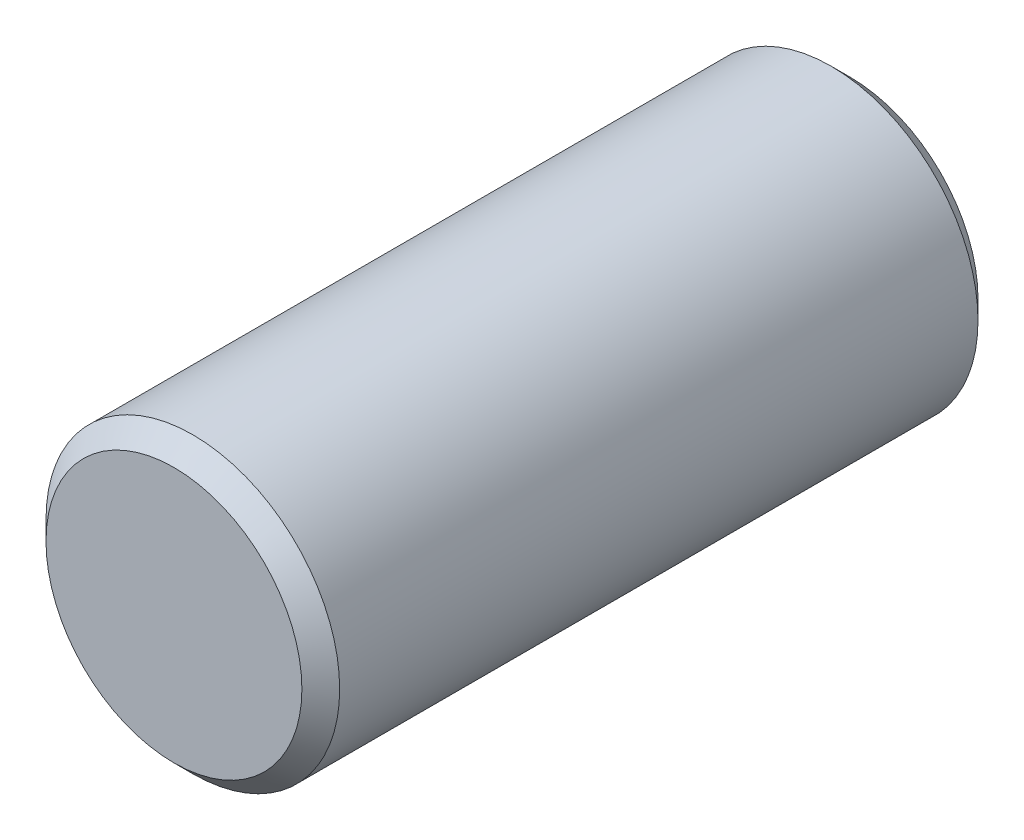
from build123d import *

# Parameters (mm, degrees)
SKETCH1_R      = 1.97485
EXTRUDE1_DEPTH = 4.5466
CHAMFER1_SIZE  = 0.254


with BuildPart() as part:
    # Sketch1 → Extrude1 (new, symmetric)
    with BuildSketch(Plane.XY):
        Circle(SKETCH1_R)
    extrude(amount=EXTRUDE1_DEPTH, both=True)

    # Chamfer1
    chamfer1_edges = [part.edges().sort_by_distance(p)[0] for p in [
        (-1.97485, 0, -4.5466),
        (-1.97485, 0, 4.5466),
    ]]
    chamfer(chamfer1_edges, length=CHAMFER1_SIZE)


solid = part.part
